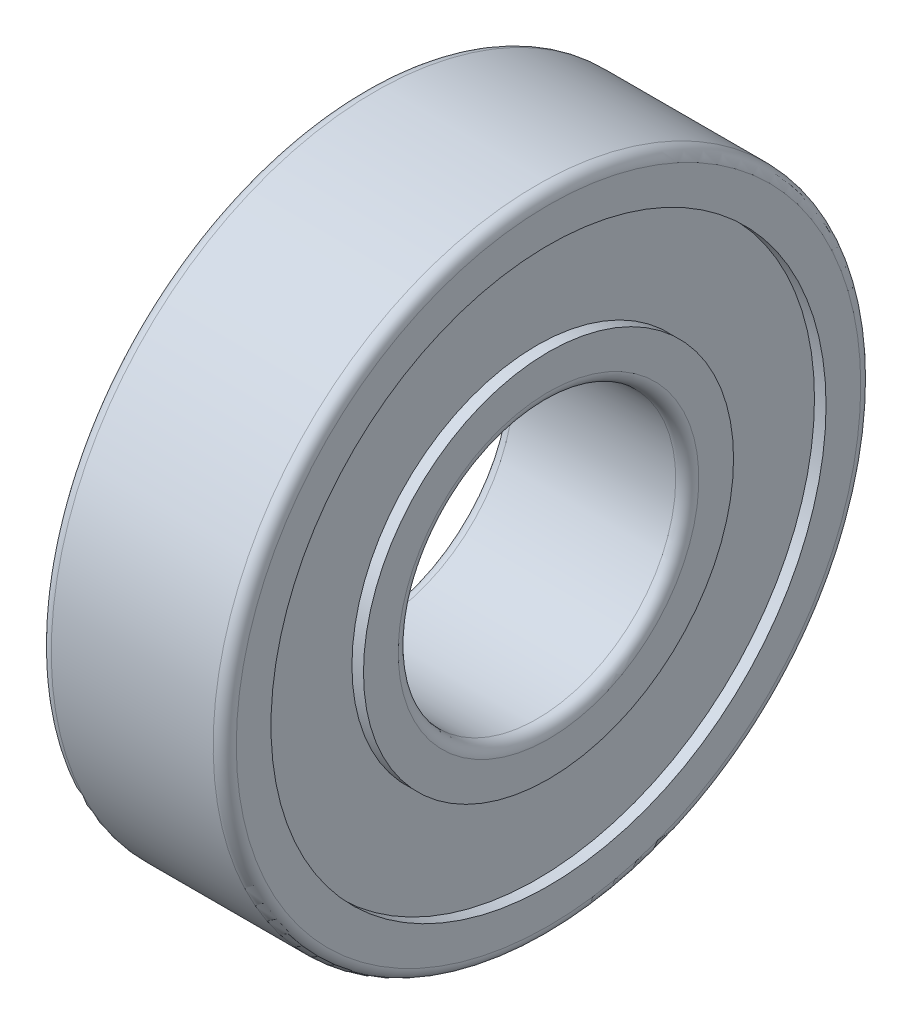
ISO-10303-21;
HEADER;
FILE_DESCRIPTION(('STEP AP214'),'2;1');
FILE_NAME('part.step','',(''),(''),'','','');
FILE_SCHEMA(('AUTOMOTIVE_DESIGN { 1 0 10303 214 1 1 1 1 }'));
ENDSEC;
DATA;
#1=APPLICATION_CONTEXT('core data for automotive mechanical design processes');
#2=APPLICATION_PROTOCOL_DEFINITION('international standard','automotive_design',2000,#1);
#3=PRODUCT_CONTEXT('',#1,'mechanical');
#4=PRODUCT('Part','Part','',(#3));
#5=PRODUCT_RELATED_PRODUCT_CATEGORY('part','',(#4));
#6=PRODUCT_DEFINITION_FORMATION('','',#4);
#7=PRODUCT_DEFINITION_CONTEXT('part definition',#1,'design');
#8=PRODUCT_DEFINITION('design','',#6,#7);
#9=PRODUCT_DEFINITION_SHAPE('','',#8);
#10=(LENGTH_UNIT() NAMED_UNIT(*) SI_UNIT(.MILLI.,.METRE.));
#11=(NAMED_UNIT(*) PLANE_ANGLE_UNIT() SI_UNIT($,.RADIAN.));
#12=(NAMED_UNIT(*) SI_UNIT($,.STERADIAN.) SOLID_ANGLE_UNIT());
#13=UNCERTAINTY_MEASURE_WITH_UNIT(LENGTH_MEASURE(1.E-05),#10,'distance_accuracy_value','');
#14=(GEOMETRIC_REPRESENTATION_CONTEXT(3) GLOBAL_UNCERTAINTY_ASSIGNED_CONTEXT((#13)) GLOBAL_UNIT_ASSIGNED_CONTEXT((#10,
#11,#12)) REPRESENTATION_CONTEXT('',''));
#15=CARTESIAN_POINT('',(0.,0.,0.));
#16=DIRECTION('',(0.,0.,1.));
#17=DIRECTION('',(1.,0.,0.));
#18=AXIS2_PLACEMENT_3D('',#15,#16,#17);
#19=CARTESIAN_POINT('',(-8.4,0.,0.));
#20=DIRECTION('',(1.,0.,0.));
#21=DIRECTION('',(0.,0.,-1.));
#22=AXIS2_PLACEMENT_3D('',#19,#20,#21);
#23=CYLINDRICAL_SURFACE('',#22,6.);
#24=CARTESIAN_POINT('',(-0.5,0.,0.));
#25=DIRECTION('',(1.,0.,0.));
#26=DIRECTION('',(0.,0.999891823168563,0.0147085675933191));
#27=AXIS2_PLACEMENT_3D('',#24,#25,#26);
#28=CIRCLE('',#27,6.);
#29=CARTESIAN_POINT('',(-0.5,5.99935093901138,0.0882514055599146));
#30=VERTEX_POINT('',#29);
#31=EDGE_CURVE('E131',#30,#30,#28,.F.);
#32=ORIENTED_EDGE('',*,*,#31,.F.);
#33=EDGE_LOOP('',(#32));
#34=FACE_BOUND('',#33,.T.);
#35=CARTESIAN_POINT('',(-7.5,0.,0.));
#36=DIRECTION('',(1.,0.,0.));
#37=DIRECTION('',(0.,0.99995043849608,0.00995593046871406));
#38=AXIS2_PLACEMENT_3D('',#35,#36,#37);
#39=CIRCLE('',#38,6.);
#40=CARTESIAN_POINT('',(-7.5,5.99970263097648,0.0597355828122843));
#41=VERTEX_POINT('',#40);
#42=EDGE_CURVE('E69',#41,#41,#39,.T.);
#43=ORIENTED_EDGE('',*,*,#42,.F.);
#44=EDGE_LOOP('',(#43));
#45=FACE_BOUND('',#44,.T.);
#46=ADVANCED_FACE('F17',(#34,#45),#23,.F.);
#47=CARTESIAN_POINT('',(-0.5,0.,0.));
#48=DIRECTION('',(1.,0.,0.));
#49=DIRECTION('',(0.,0.999891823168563,0.0147085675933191));
#50=AXIS2_PLACEMENT_3D('',#47,#48,#49);
#51=TOROIDAL_SURFACE('',#50,6.5,0.5);
#52=ORIENTED_EDGE('',*,*,#31,.T.);
#53=EDGE_LOOP('',(#52));
#54=FACE_BOUND('',#53,.T.);
#55=CARTESIAN_POINT('',(0.,0.,0.));
#56=DIRECTION('',(1.,0.,0.));
#57=DIRECTION('',(0.,-1.,-8.74409052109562E-13));
#58=AXIS2_PLACEMENT_3D('',#55,#56,#57);
#59=CIRCLE('',#58,6.49999999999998);
#60=CARTESIAN_POINT('',(0.,6.49999999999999,1.16358330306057E-12));
#61=VERTEX_POINT('',#60);
#62=CARTESIAN_POINT('',(0.,-6.49999999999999,-2.28809738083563E-12));
#63=VERTEX_POINT('',#62);
#64=EDGE_CURVE('E58',#61,#63,#59,.F.);
#65=ORIENTED_EDGE('',*,*,#64,.F.);
#66=CARTESIAN_POINT('',(0.,0.,0.));
#67=DIRECTION('',(1.,0.,0.));
#68=DIRECTION('',(0.,1.,0.));
#69=AXIS2_PLACEMENT_3D('',#66,#67,#68);
#70=CIRCLE('',#69,6.5);
#71=EDGE_CURVE('E56',#63,#61,#70,.F.);
#72=ORIENTED_EDGE('',*,*,#71,.F.);
#73=EDGE_LOOP('',(#65,#72));
#74=FACE_BOUND('',#73,.T.);
#75=ADVANCED_FACE('F60',(#54,#74),#51,.T.);
#76=CARTESIAN_POINT('',(-7.5,0.,0.));
#77=DIRECTION('',(1.,0.,0.));
#78=DIRECTION('',(0.,0.99995043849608,0.00995593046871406));
#79=AXIS2_PLACEMENT_3D('',#76,#77,#78);
#80=TOROIDAL_SURFACE('',#79,6.5,0.5);
#81=CARTESIAN_POINT('',(-8.,0.,0.));
#82=DIRECTION('',(-1.,0.,0.));
#83=DIRECTION('',(0.,-1.,0.));
#84=AXIS2_PLACEMENT_3D('',#81,#82,#83);
#85=CIRCLE('',#84,6.5);
#86=CARTESIAN_POINT('',(-8.,-6.49999999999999,-5.23458056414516E-13));
#87=VERTEX_POINT('',#86);
#88=CARTESIAN_POINT('',(-8.,6.49999999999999,1.03044056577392E-12));
#89=VERTEX_POINT('',#88);
#90=EDGE_CURVE('E63',#87,#89,#85,.T.);
#91=ORIENTED_EDGE('',*,*,#90,.T.);
#92=CARTESIAN_POINT('',(-8.,0.,0.));
#93=DIRECTION('',(-1.,0.,0.));
#94=DIRECTION('',(0.,1.,3.9378848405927E-13));
#95=AXIS2_PLACEMENT_3D('',#92,#93,#94);
#96=CIRCLE('',#95,6.49999999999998);
#97=EDGE_CURVE('E107',#89,#87,#96,.T.);
#98=ORIENTED_EDGE('',*,*,#97,.T.);
#99=EDGE_LOOP('',(#91,#98));
#100=FACE_BOUND('',#99,.T.);
#101=ORIENTED_EDGE('',*,*,#42,.T.);
#102=EDGE_LOOP('',(#101));
#103=FACE_BOUND('',#102,.T.);
#104=ADVANCED_FACE('F89',(#100,#103),#80,.T.);
#105=CARTESIAN_POINT('',(0.,0.,0.));
#106=DIRECTION('',(1.,0.,0.));
#107=DIRECTION('',(0.,0.,-1.));
#108=AXIS2_PLACEMENT_3D('',#105,#106,#107);
#109=PLANE('',#108);
#110=ORIENTED_EDGE('',*,*,#71,.T.);
#111=ORIENTED_EDGE('',*,*,#64,.T.);
#112=EDGE_LOOP('',(#110,#111));
#113=FACE_BOUND('',#112,.T.);
#114=CARTESIAN_POINT('',(0.,0.,0.));
#115=DIRECTION('',(1.,0.,0.));
#116=DIRECTION('',(0.,0.,-1.));
#117=AXIS2_PLACEMENT_3D('',#114,#115,#116);
#118=CIRCLE('',#117,8.);
#119=CARTESIAN_POINT('',(0.,0.,-8.));
#120=VERTEX_POINT('',#119);
#121=EDGE_CURVE('E157',#120,#120,#118,.F.);
#122=ORIENTED_EDGE('',*,*,#121,.F.);
#123=EDGE_LOOP('',(#122));
#124=FACE_BOUND('',#123,.T.);
#125=ADVANCED_FACE('F67',(#113,#124),#109,.T.);
#126=CARTESIAN_POINT('',(-8.,0.,0.));
#127=DIRECTION('',(1.,0.,0.));
#128=DIRECTION('',(0.,0.,-1.));
#129=AXIS2_PLACEMENT_3D('',#126,#127,#128);
#130=PLANE('',#129);
#131=ORIENTED_EDGE('',*,*,#90,.F.);
#132=ORIENTED_EDGE('',*,*,#97,.F.);
#133=EDGE_LOOP('',(#131,#132));
#134=FACE_BOUND('',#133,.T.);
#135=CARTESIAN_POINT('',(-8.,0.,0.));
#136=DIRECTION('',(1.,0.,0.));
#137=DIRECTION('',(0.,0.,-1.));
#138=AXIS2_PLACEMENT_3D('',#135,#136,#137);
#139=CIRCLE('',#138,8.);
#140=CARTESIAN_POINT('',(-8.,0.,-8.));
#141=VERTEX_POINT('',#140);
#142=EDGE_CURVE('E154',#141,#141,#139,.T.);
#143=ORIENTED_EDGE('',*,*,#142,.F.);
#144=EDGE_LOOP('',(#143));
#145=FACE_BOUND('',#144,.T.);
#146=ADVANCED_FACE('F88',(#134,#145),#130,.F.);
#147=CARTESIAN_POINT('',(-8.4,0.,0.));
#148=DIRECTION('',(1.,0.,0.));
#149=DIRECTION('',(0.,0.,-1.));
#150=AXIS2_PLACEMENT_3D('',#147,#148,#149);
#151=CYLINDRICAL_SURFACE('',#150,8.);
#152=CARTESIAN_POINT('',(-0.499999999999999,0.,0.));
#153=DIRECTION('',(1.,0.,0.));
#154=DIRECTION('',(0.,0.,-1.));
#155=AXIS2_PLACEMENT_3D('',#152,#153,#154);
#156=CIRCLE('',#155,8.);
#157=CARTESIAN_POINT('',(-0.499999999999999,0.,-8.));
#158=VERTEX_POINT('',#157);
#159=EDGE_CURVE('E151',#158,#158,#156,.F.);
#160=ORIENTED_EDGE('',*,*,#159,.F.);
#161=EDGE_LOOP('',(#160));
#162=FACE_BOUND('',#161,.T.);
#163=ORIENTED_EDGE('',*,*,#121,.T.);
#164=EDGE_LOOP('',(#163));
#165=FACE_BOUND('',#164,.T.);
#166=ADVANCED_FACE('F367',(#162,#165),#151,.T.);
#167=CARTESIAN_POINT('',(-8.4,0.,0.));
#168=DIRECTION('',(1.,0.,0.));
#169=DIRECTION('',(0.,0.,-1.));
#170=AXIS2_PLACEMENT_3D('',#167,#168,#169);
#171=CYLINDRICAL_SURFACE('',#170,8.);
#172=ORIENTED_EDGE('',*,*,#142,.T.);
#173=EDGE_LOOP('',(#172));
#174=FACE_BOUND('',#173,.T.);
#175=CARTESIAN_POINT('',(-7.5,0.,0.));
#176=DIRECTION('',(1.,0.,0.));
#177=DIRECTION('',(0.,0.,-1.));
#178=AXIS2_PLACEMENT_3D('',#175,#176,#177);
#179=CIRCLE('',#178,8.);
#180=CARTESIAN_POINT('',(-7.5,0.,-8.));
#181=VERTEX_POINT('',#180);
#182=EDGE_CURVE('E148',#181,#181,#179,.F.);
#183=ORIENTED_EDGE('',*,*,#182,.T.);
#184=EDGE_LOOP('',(#183));
#185=FACE_BOUND('',#184,.T.);
#186=ADVANCED_FACE('F358',(#174,#185),#171,.T.);
#187=CARTESIAN_POINT('',(-0.5,0.,0.));
#188=DIRECTION('',(1.,0.,0.));
#189=DIRECTION('',(0.,0.,-1.));
#190=AXIS2_PLACEMENT_3D('',#187,#188,#189);
#191=PLANE('',#190);
#192=ORIENTED_EDGE('',*,*,#159,.T.);
#193=EDGE_LOOP('',(#192));
#194=FACE_BOUND('',#193,.T.);
#195=CARTESIAN_POINT('',(-0.499999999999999,0.,0.));
#196=DIRECTION('',(1.,0.,0.));
#197=DIRECTION('',(0.,0.,-1.));
#198=AXIS2_PLACEMENT_3D('',#195,#196,#197);
#199=CIRCLE('',#198,12.);
#200=CARTESIAN_POINT('',(-0.499999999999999,0.,-12.));
#201=VERTEX_POINT('',#200);
#202=EDGE_CURVE('E145',#201,#201,#199,.T.);
#203=ORIENTED_EDGE('',*,*,#202,.T.);
#204=EDGE_LOOP('',(#203));
#205=FACE_BOUND('',#204,.T.);
#206=ADVANCED_FACE('F349',(#194,#205),#191,.T.);
#207=CARTESIAN_POINT('',(-7.5,0.,0.));
#208=DIRECTION('',(1.,0.,0.));
#209=DIRECTION('',(0.,0.,-1.));
#210=AXIS2_PLACEMENT_3D('',#207,#208,#209);
#211=PLANE('',#210);
#212=ORIENTED_EDGE('',*,*,#182,.F.);
#213=EDGE_LOOP('',(#212));
#214=FACE_BOUND('',#213,.T.);
#215=CARTESIAN_POINT('',(-7.5,0.,0.));
#216=DIRECTION('',(1.,0.,0.));
#217=DIRECTION('',(0.,0.,-1.));
#218=AXIS2_PLACEMENT_3D('',#215,#216,#217);
#219=CIRCLE('',#218,12.);
#220=CARTESIAN_POINT('',(-7.5,0.,-12.));
#221=VERTEX_POINT('',#220);
#222=EDGE_CURVE('E142',#221,#221,#219,.F.);
#223=ORIENTED_EDGE('',*,*,#222,.T.);
#224=EDGE_LOOP('',(#223));
#225=FACE_BOUND('',#224,.T.);
#226=ADVANCED_FACE('F341',(#214,#225),#211,.F.);
#227=CARTESIAN_POINT('',(-8.4,0.,0.));
#228=DIRECTION('',(1.,0.,0.));
#229=DIRECTION('',(0.,0.,-1.));
#230=AXIS2_PLACEMENT_3D('',#227,#228,#229);
#231=CYLINDRICAL_SURFACE('',#230,12.);
#232=CARTESIAN_POINT('',(0.,0.,0.));
#233=DIRECTION('',(1.,0.,0.));
#234=DIRECTION('',(0.,0.,-1.));
#235=AXIS2_PLACEMENT_3D('',#232,#233,#234);
#236=CIRCLE('',#235,12.);
#237=CARTESIAN_POINT('',(0.,0.,-12.));
#238=VERTEX_POINT('',#237);
#239=EDGE_CURVE('E138',#238,#238,#236,.F.);
#240=ORIENTED_EDGE('',*,*,#239,.F.);
#241=EDGE_LOOP('',(#240));
#242=FACE_BOUND('',#241,.T.);
#243=ORIENTED_EDGE('',*,*,#202,.F.);
#244=EDGE_LOOP('',(#243));
#245=FACE_BOUND('',#244,.T.);
#246=ADVANCED_FACE('F333',(#242,#245),#231,.F.);
#247=CARTESIAN_POINT('',(-8.4,0.,0.));
#248=DIRECTION('',(1.,0.,0.));
#249=DIRECTION('',(0.,0.,-1.));
#250=AXIS2_PLACEMENT_3D('',#247,#248,#249);
#251=CYLINDRICAL_SURFACE('',#250,12.);
#252=ORIENTED_EDGE('',*,*,#222,.F.);
#253=EDGE_LOOP('',(#252));
#254=FACE_BOUND('',#253,.T.);
#255=CARTESIAN_POINT('',(-8.,0.,0.));
#256=DIRECTION('',(1.,0.,0.));
#257=DIRECTION('',(0.,0.,-1.));
#258=AXIS2_PLACEMENT_3D('',#255,#256,#257);
#259=CIRCLE('',#258,12.);
#260=CARTESIAN_POINT('',(-8.,0.,-12.));
#261=VERTEX_POINT('',#260);
#262=EDGE_CURVE('E134',#261,#261,#259,.F.);
#263=ORIENTED_EDGE('',*,*,#262,.T.);
#264=EDGE_LOOP('',(#263));
#265=FACE_BOUND('',#264,.T.);
#266=ADVANCED_FACE('F235',(#254,#265),#251,.F.);
#267=CARTESIAN_POINT('',(0.,0.,0.));
#268=DIRECTION('',(1.,0.,0.));
#269=DIRECTION('',(0.,0.,-1.));
#270=AXIS2_PLACEMENT_3D('',#267,#268,#269);
#271=PLANE('',#270);
#272=ORIENTED_EDGE('',*,*,#239,.T.);
#273=EDGE_LOOP('',(#272));
#274=FACE_BOUND('',#273,.T.);
#275=CARTESIAN_POINT('',(0.,0.,0.));
#276=DIRECTION('',(-1.,0.,0.));
#277=DIRECTION('',(0.,-1.,-1.69423655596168E-13));
#278=AXIS2_PLACEMENT_3D('',#275,#276,#277);
#279=CIRCLE('',#278,13.5);
#280=CARTESIAN_POINT('',(0.,-13.5,-9.1980851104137E-13));
#281=VERTEX_POINT('',#280);
#282=CARTESIAN_POINT('',(0.,13.5,4.6383923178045E-13));
#283=VERTEX_POINT('',#282);
#284=EDGE_CURVE('E137',#281,#283,#279,.T.);
#285=ORIENTED_EDGE('',*,*,#284,.F.);
#286=CARTESIAN_POINT('',(0.,0.,0.));
#287=DIRECTION('',(-1.,0.,0.));
#288=DIRECTION('',(0.,1.,0.));
#289=AXIS2_PLACEMENT_3D('',#286,#287,#288);
#290=CIRCLE('',#289,13.5);
#291=EDGE_CURVE('E141',#283,#281,#290,.T.);
#292=ORIENTED_EDGE('',*,*,#291,.F.);
#293=EDGE_LOOP('',(#285,#292));
#294=FACE_BOUND('',#293,.T.);
#295=ADVANCED_FACE('F226',(#274,#294),#271,.T.);
#296=CARTESIAN_POINT('',(-8.,0.,0.));
#297=DIRECTION('',(1.,0.,0.));
#298=DIRECTION('',(0.,0.,-1.));
#299=AXIS2_PLACEMENT_3D('',#296,#297,#298);
#300=PLANE('',#299);
#301=ORIENTED_EDGE('',*,*,#262,.F.);
#302=EDGE_LOOP('',(#301));
#303=FACE_BOUND('',#302,.T.);
#304=CARTESIAN_POINT('',(-8.,0.,0.));
#305=DIRECTION('',(1.,0.,0.));
#306=DIRECTION('',(0.,1.,3.93174875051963E-13));
#307=AXIS2_PLACEMENT_3D('',#304,#305,#306);
#308=CIRCLE('',#307,13.5);
#309=CARTESIAN_POINT('',(-8.,13.5,1.05917871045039E-12));
#310=VERTEX_POINT('',#309);
#311=CARTESIAN_POINT('',(-8.,-13.5,-2.12611759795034E-12));
#312=VERTEX_POINT('',#311);
#313=EDGE_CURVE('E193',#310,#312,#308,.T.);
#314=ORIENTED_EDGE('',*,*,#313,.F.);
#315=CARTESIAN_POINT('',(-8.,0.,0.));
#316=DIRECTION('',(1.,0.,0.));
#317=DIRECTION('',(0.,-1.,0.));
#318=AXIS2_PLACEMENT_3D('',#315,#316,#317);
#319=CIRCLE('',#318,13.5);
#320=EDGE_CURVE('E35',#312,#310,#319,.T.);
#321=ORIENTED_EDGE('',*,*,#320,.F.);
#322=EDGE_LOOP('',(#314,#321));
#323=FACE_BOUND('',#322,.T.);
#324=ADVANCED_FACE('F180',(#303,#323),#300,.F.);
#325=CARTESIAN_POINT('',(-0.5,0.,0.));
#326=DIRECTION('',(1.,0.,0.));
#327=DIRECTION('',(0.,-0.999990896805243,-0.00426688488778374));
#328=AXIS2_PLACEMENT_3D('',#325,#326,#327);
#329=TOROIDAL_SURFACE('',#328,13.5,0.5);
#330=ORIENTED_EDGE('',*,*,#291,.T.);
#331=ORIENTED_EDGE('',*,*,#284,.T.);
#332=EDGE_LOOP('',(#330,#331));
#333=FACE_BOUND('',#332,.T.);
#334=CARTESIAN_POINT('',(-0.499999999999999,0.,0.));
#335=DIRECTION('',(1.,0.,0.));
#336=DIRECTION('',(0.,0.,-1.));
#337=AXIS2_PLACEMENT_3D('',#334,#335,#336);
#338=CIRCLE('',#337,14.);
#339=CARTESIAN_POINT('',(-0.499999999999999,0.,-14.));
#340=VERTEX_POINT('',#339);
#341=EDGE_CURVE('E27',#340,#340,#338,.F.);
#342=ORIENTED_EDGE('',*,*,#341,.F.);
#343=EDGE_LOOP('',(#342));
#344=FACE_BOUND('',#343,.T.);
#345=ADVANCED_FACE('F168',(#333,#344),#329,.T.);
#346=CARTESIAN_POINT('',(-7.5,0.,0.));
#347=DIRECTION('',(1.,0.,0.));
#348=DIRECTION('',(0.,-0.999980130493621,-0.00630385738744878));
#349=AXIS2_PLACEMENT_3D('',#346,#347,#348);
#350=TOROIDAL_SURFACE('',#349,13.5,0.5);
#351=CARTESIAN_POINT('',(-7.5,0.,0.));
#352=DIRECTION('',(1.,0.,0.));
#353=DIRECTION('',(0.,0.,-1.));
#354=AXIS2_PLACEMENT_3D('',#351,#352,#353);
#355=CIRCLE('',#354,14.);
#356=CARTESIAN_POINT('',(-7.5,0.,-14.));
#357=VERTEX_POINT('',#356);
#358=EDGE_CURVE('E11',#357,#357,#355,.T.);
#359=ORIENTED_EDGE('',*,*,#358,.F.);
#360=EDGE_LOOP('',(#359));
#361=FACE_BOUND('',#360,.T.);
#362=ORIENTED_EDGE('',*,*,#320,.T.);
#363=ORIENTED_EDGE('',*,*,#313,.T.);
#364=EDGE_LOOP('',(#362,#363));
#365=FACE_BOUND('',#364,.T.);
#366=ADVANCED_FACE('F179',(#361,#365),#350,.T.);
#367=CARTESIAN_POINT('',(-8.4,0.,0.));
#368=DIRECTION('',(1.,0.,0.));
#369=DIRECTION('',(0.,0.,-1.));
#370=AXIS2_PLACEMENT_3D('',#367,#368,#369);
#371=CYLINDRICAL_SURFACE('',#370,14.);
#372=ORIENTED_EDGE('',*,*,#341,.T.);
#373=EDGE_LOOP('',(#372));
#374=FACE_BOUND('',#373,.T.);
#375=ORIENTED_EDGE('',*,*,#358,.T.);
#376=EDGE_LOOP('',(#375));
#377=FACE_BOUND('',#376,.T.);
#378=ADVANCED_FACE('F293',(#374,#377),#371,.T.);
#379=CLOSED_SHELL('',(#46,#75,#104,#125,#146,#166,#186,#206,#226,#246,#266,#295,#324,#345,#366,#378));
#380=MANIFOLD_SOLID_BREP('B1',#379);
#381=ADVANCED_BREP_SHAPE_REPRESENTATION('',(#18,#380),#14);
#382=SHAPE_DEFINITION_REPRESENTATION(#9,#381);
ENDSEC;
END-ISO-10303-21;
